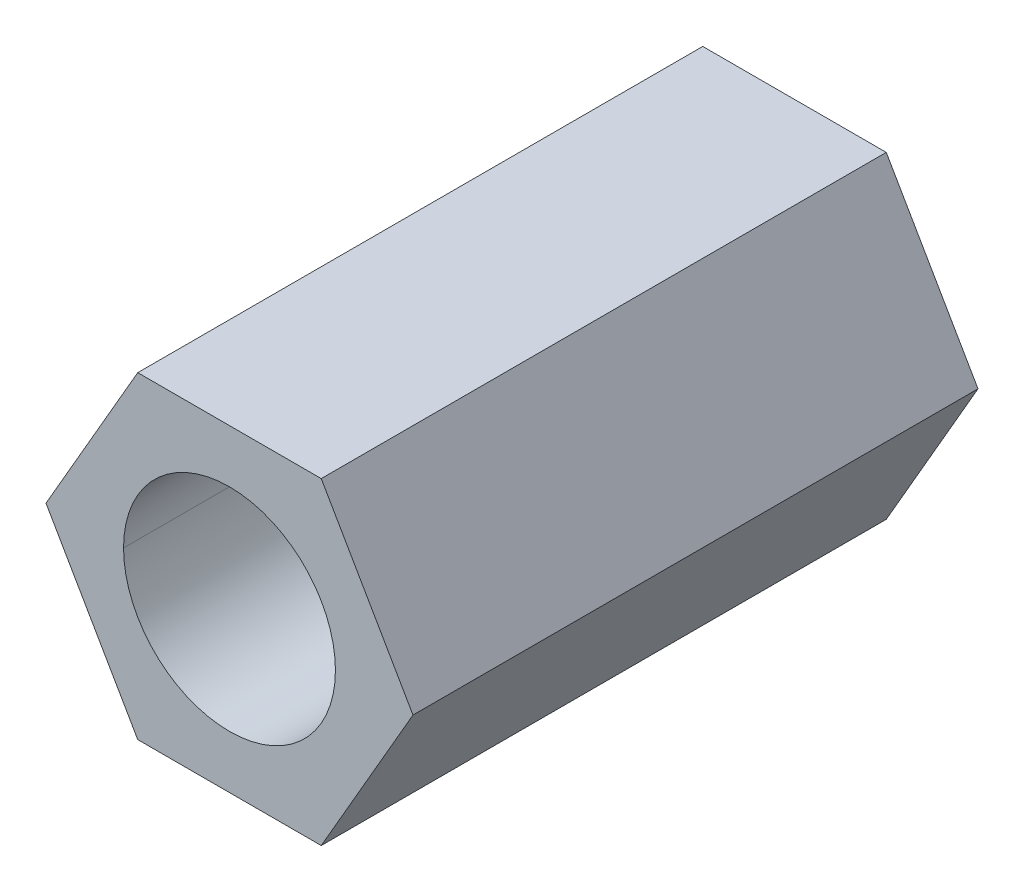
ISO-10303-21;
HEADER;
FILE_DESCRIPTION(('STEP AP214'),'2;1');
FILE_NAME('part.step','',(''),(''),'','','');
FILE_SCHEMA(('AUTOMOTIVE_DESIGN { 1 0 10303 214 1 1 1 1 }'));
ENDSEC;
DATA;
#1=APPLICATION_CONTEXT('core data for automotive mechanical design processes');
#2=APPLICATION_PROTOCOL_DEFINITION('international standard','automotive_design',2000,#1);
#3=PRODUCT_CONTEXT('',#1,'mechanical');
#4=PRODUCT('Part','Part','',(#3));
#5=PRODUCT_RELATED_PRODUCT_CATEGORY('part','',(#4));
#6=PRODUCT_DEFINITION_FORMATION('','',#4);
#7=PRODUCT_DEFINITION_CONTEXT('part definition',#1,'design');
#8=PRODUCT_DEFINITION('design','',#6,#7);
#9=PRODUCT_DEFINITION_SHAPE('','',#8);
#10=(LENGTH_UNIT() NAMED_UNIT(*) SI_UNIT(.MILLI.,.METRE.));
#11=(NAMED_UNIT(*) PLANE_ANGLE_UNIT() SI_UNIT($,.RADIAN.));
#12=(NAMED_UNIT(*) SI_UNIT($,.STERADIAN.) SOLID_ANGLE_UNIT());
#13=UNCERTAINTY_MEASURE_WITH_UNIT(LENGTH_MEASURE(1.E-05),#10,'distance_accuracy_value','');
#14=(GEOMETRIC_REPRESENTATION_CONTEXT(3) GLOBAL_UNCERTAINTY_ASSIGNED_CONTEXT((#13)) GLOBAL_UNIT_ASSIGNED_CONTEXT((#10,
#11,#12)) REPRESENTATION_CONTEXT('',''));
#15=CARTESIAN_POINT('',(0.,0.,0.));
#16=DIRECTION('',(0.,0.,1.));
#17=DIRECTION('',(1.,0.,0.));
#18=AXIS2_PLACEMENT_3D('',#15,#16,#17);
#19=CARTESIAN_POINT('',(1.299038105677,-2.25,0.));
#20=DIRECTION('',(0.866025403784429,-0.500000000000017,0.));
#21=DIRECTION('',(0.,0.,-1.));
#22=AXIS2_PLACEMENT_3D('',#19,#20,#21);
#23=PLANE('',#22);
#24=DIRECTION('',(0.,0.,1.));
#25=VECTOR('',#24,1.);
#26=CARTESIAN_POINT('',(2.598076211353,0.,0.));
#27=LINE('',#26,#25);
#28=CARTESIAN_POINT('',(2.598076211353,0.,0.));
#29=VERTEX_POINT('',#28);
#30=CARTESIAN_POINT('',(2.598076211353,0.,8.));
#31=VERTEX_POINT('',#30);
#32=EDGE_CURVE('E11',#29,#31,#27,.T.);
#33=ORIENTED_EDGE('',*,*,#32,.T.);
#34=DIRECTION('',(0.500000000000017,0.866025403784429,0.));
#35=VECTOR('',#34,1.);
#36=CARTESIAN_POINT('',(1.299038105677,-2.25,8.));
#37=LINE('',#36,#35);
#38=CARTESIAN_POINT('',(1.299038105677,-2.25,8.));
#39=VERTEX_POINT('',#38);
#40=EDGE_CURVE('E122',#39,#31,#37,.T.);
#41=ORIENTED_EDGE('',*,*,#40,.F.);
#42=DIRECTION('',(0.,0.,1.));
#43=VECTOR('',#42,1.);
#44=CARTESIAN_POINT('',(1.299038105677,-2.25,0.));
#45=LINE('',#44,#43);
#46=CARTESIAN_POINT('',(1.299038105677,-2.25,0.));
#47=VERTEX_POINT('',#46);
#48=EDGE_CURVE('E108',#47,#39,#45,.T.);
#49=ORIENTED_EDGE('',*,*,#48,.F.);
#50=DIRECTION('',(0.500000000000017,0.866025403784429,0.));
#51=VECTOR('',#50,1.);
#52=CARTESIAN_POINT('',(1.299038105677,-2.25,0.));
#53=LINE('',#52,#51);
#54=EDGE_CURVE('E174',#47,#29,#53,.T.);
#55=ORIENTED_EDGE('',*,*,#54,.T.);
#56=EDGE_LOOP('',(#33,#41,#49,#55));
#57=FACE_BOUND('',#56,.T.);
#58=ADVANCED_FACE('F17',(#57),#23,.T.);
#59=CARTESIAN_POINT('',(2.598076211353,0.,0.));
#60=DIRECTION('',(0.866025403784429,0.500000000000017,0.));
#61=DIRECTION('',(0.,0.,-1.));
#62=AXIS2_PLACEMENT_3D('',#59,#60,#61);
#63=PLANE('',#62);
#64=DIRECTION('',(0.,0.,1.));
#65=VECTOR('',#64,1.);
#66=CARTESIAN_POINT('',(1.299038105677,2.25,0.));
#67=LINE('',#66,#65);
#68=CARTESIAN_POINT('',(1.299038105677,2.25,0.));
#69=VERTEX_POINT('',#68);
#70=CARTESIAN_POINT('',(1.299038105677,2.25,8.));
#71=VERTEX_POINT('',#70);
#72=EDGE_CURVE('E28',#69,#71,#67,.T.);
#73=ORIENTED_EDGE('',*,*,#72,.T.);
#74=DIRECTION('',(-0.500000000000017,0.866025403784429,0.));
#75=VECTOR('',#74,1.);
#76=CARTESIAN_POINT('',(2.598076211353,0.,8.));
#77=LINE('',#76,#75);
#78=EDGE_CURVE('E128',#31,#71,#77,.T.);
#79=ORIENTED_EDGE('',*,*,#78,.F.);
#80=ORIENTED_EDGE('',*,*,#32,.F.);
#81=DIRECTION('',(-0.500000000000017,0.866025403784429,0.));
#82=VECTOR('',#81,1.);
#83=CARTESIAN_POINT('',(2.598076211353,0.,0.));
#84=LINE('',#83,#82);
#85=EDGE_CURVE('E177',#29,#69,#84,.T.);
#86=ORIENTED_EDGE('',*,*,#85,.T.);
#87=EDGE_LOOP('',(#73,#79,#80,#86));
#88=FACE_BOUND('',#87,.T.);
#89=ADVANCED_FACE('F204',(#88),#63,.T.);
#90=CARTESIAN_POINT('',(1.299038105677,2.25,0.));
#91=DIRECTION('',(0.,1.,0.));
#92=DIRECTION('',(1.,0.,0.));
#93=AXIS2_PLACEMENT_3D('',#90,#91,#92);
#94=PLANE('',#93);
#95=DIRECTION('',(0.,0.,1.));
#96=VECTOR('',#95,1.);
#97=CARTESIAN_POINT('',(-1.299038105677,2.25,0.));
#98=LINE('',#97,#96);
#99=CARTESIAN_POINT('',(-1.299038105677,2.25,0.));
#100=VERTEX_POINT('',#99);
#101=CARTESIAN_POINT('',(-1.299038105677,2.25,8.));
#102=VERTEX_POINT('',#101);
#103=EDGE_CURVE('E145',#100,#102,#98,.T.);
#104=ORIENTED_EDGE('',*,*,#103,.T.);
#105=DIRECTION('',(-1.,0.,0.));
#106=VECTOR('',#105,1.);
#107=CARTESIAN_POINT('',(1.299038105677,2.25,8.));
#108=LINE('',#107,#106);
#109=EDGE_CURVE('E135',#71,#102,#108,.T.);
#110=ORIENTED_EDGE('',*,*,#109,.F.);
#111=ORIENTED_EDGE('',*,*,#72,.F.);
#112=DIRECTION('',(-1.,0.,0.));
#113=VECTOR('',#112,1.);
#114=CARTESIAN_POINT('',(1.299038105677,2.25,0.));
#115=LINE('',#114,#113);
#116=EDGE_CURVE('E151',#69,#100,#115,.T.);
#117=ORIENTED_EDGE('',*,*,#116,.T.);
#118=EDGE_LOOP('',(#104,#110,#111,#117));
#119=FACE_BOUND('',#118,.T.);
#120=ADVANCED_FACE('F209',(#119),#94,.T.);
#121=CARTESIAN_POINT('',(-1.299038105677,2.25,0.));
#122=DIRECTION('',(-0.866025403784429,0.500000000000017,0.));
#123=DIRECTION('',(0.,0.,1.));
#124=AXIS2_PLACEMENT_3D('',#121,#122,#123);
#125=PLANE('',#124);
#126=DIRECTION('',(0.,0.,1.));
#127=VECTOR('',#126,1.);
#128=CARTESIAN_POINT('',(-2.598076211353,0.,0.));
#129=LINE('',#128,#127);
#130=CARTESIAN_POINT('',(-2.598076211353,0.,0.));
#131=VERTEX_POINT('',#130);
#132=CARTESIAN_POINT('',(-2.598076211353,0.,8.));
#133=VERTEX_POINT('',#132);
#134=EDGE_CURVE('E21',#131,#133,#129,.T.);
#135=ORIENTED_EDGE('',*,*,#134,.T.);
#136=DIRECTION('',(-0.500000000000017,-0.866025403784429,0.));
#137=VECTOR('',#136,1.);
#138=CARTESIAN_POINT('',(-1.299038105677,2.25,8.));
#139=LINE('',#138,#137);
#140=EDGE_CURVE('E140',#102,#133,#139,.T.);
#141=ORIENTED_EDGE('',*,*,#140,.F.);
#142=ORIENTED_EDGE('',*,*,#103,.F.);
#143=DIRECTION('',(-0.500000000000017,-0.866025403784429,0.));
#144=VECTOR('',#143,1.);
#145=CARTESIAN_POINT('',(-1.299038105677,2.25,0.));
#146=LINE('',#145,#144);
#147=EDGE_CURVE('E147',#100,#131,#146,.T.);
#148=ORIENTED_EDGE('',*,*,#147,.T.);
#149=EDGE_LOOP('',(#135,#141,#142,#148));
#150=FACE_BOUND('',#149,.T.);
#151=ADVANCED_FACE('F213',(#150),#125,.T.);
#152=CARTESIAN_POINT('',(-2.598076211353,0.,0.));
#153=DIRECTION('',(-0.866025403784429,-0.500000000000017,0.));
#154=DIRECTION('',(-0.500000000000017,0.866025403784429,0.));
#155=AXIS2_PLACEMENT_3D('',#152,#153,#154);
#156=PLANE('',#155);
#157=DIRECTION('',(0.,0.,1.));
#158=VECTOR('',#157,1.);
#159=CARTESIAN_POINT('',(-1.299038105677,-2.25,0.));
#160=LINE('',#159,#158);
#161=CARTESIAN_POINT('',(-1.299038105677,-2.25,0.));
#162=VERTEX_POINT('',#161);
#163=CARTESIAN_POINT('',(-1.299038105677,-2.25,8.));
#164=VERTEX_POINT('',#163);
#165=EDGE_CURVE('E42',#162,#164,#160,.T.);
#166=ORIENTED_EDGE('',*,*,#165,.T.);
#167=DIRECTION('',(0.500000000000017,-0.866025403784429,0.));
#168=VECTOR('',#167,1.);
#169=CARTESIAN_POINT('',(-2.598076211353,0.,8.));
#170=LINE('',#169,#168);
#171=EDGE_CURVE('E124',#133,#164,#170,.T.);
#172=ORIENTED_EDGE('',*,*,#171,.F.);
#173=ORIENTED_EDGE('',*,*,#134,.F.);
#174=DIRECTION('',(0.500000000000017,-0.866025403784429,0.));
#175=VECTOR('',#174,1.);
#176=CARTESIAN_POINT('',(-2.598076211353,0.,0.));
#177=LINE('',#176,#175);
#178=EDGE_CURVE('E152',#131,#162,#177,.T.);
#179=ORIENTED_EDGE('',*,*,#178,.T.);
#180=EDGE_LOOP('',(#166,#172,#173,#179));
#181=FACE_BOUND('',#180,.T.);
#182=ADVANCED_FACE('F200',(#181),#156,.T.);
#183=CARTESIAN_POINT('',(-1.299038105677,-2.25,0.));
#184=DIRECTION('',(0.,-1.,0.));
#185=DIRECTION('',(0.,0.,-1.));
#186=AXIS2_PLACEMENT_3D('',#183,#184,#185);
#187=PLANE('',#186);
#188=ORIENTED_EDGE('',*,*,#48,.T.);
#189=DIRECTION('',(1.,0.,0.));
#190=VECTOR('',#189,1.);
#191=CARTESIAN_POINT('',(-1.299038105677,-2.25,8.));
#192=LINE('',#191,#190);
#193=EDGE_CURVE('E111',#164,#39,#192,.T.);
#194=ORIENTED_EDGE('',*,*,#193,.F.);
#195=ORIENTED_EDGE('',*,*,#165,.F.);
#196=DIRECTION('',(1.,0.,0.));
#197=VECTOR('',#196,1.);
#198=CARTESIAN_POINT('',(-1.299038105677,-2.25,0.));
#199=LINE('',#198,#197);
#200=EDGE_CURVE('E114',#162,#47,#199,.T.);
#201=ORIENTED_EDGE('',*,*,#200,.T.);
#202=EDGE_LOOP('',(#188,#194,#195,#201));
#203=FACE_BOUND('',#202,.T.);
#204=ADVANCED_FACE('F110',(#203),#187,.T.);
#205=CARTESIAN_POINT('',(0.,0.,8.));
#206=DIRECTION('',(0.,0.,1.));
#207=DIRECTION('',(1.,0.,0.));
#208=AXIS2_PLACEMENT_3D('',#205,#206,#207);
#209=PLANE('',#208);
#210=CARTESIAN_POINT('',(0.,0.,8.));
#211=DIRECTION('',(0.,0.,-1.));
#212=DIRECTION('',(-1.,0.,0.));
#213=AXIS2_PLACEMENT_3D('',#210,#211,#212);
#214=CIRCLE('',#213,1.5);
#215=CARTESIAN_POINT('',(-1.5,0.,8.));
#216=VERTEX_POINT('',#215);
#217=CARTESIAN_POINT('',(1.5,0.,8.));
#218=VERTEX_POINT('',#217);
#219=EDGE_CURVE('E129',#216,#218,#214,.T.);
#220=ORIENTED_EDGE('',*,*,#219,.T.);
#221=CARTESIAN_POINT('',(0.,0.,8.));
#222=DIRECTION('',(0.,0.,-1.));
#223=DIRECTION('',(1.,0.,0.));
#224=AXIS2_PLACEMENT_3D('',#221,#222,#223);
#225=CIRCLE('',#224,1.5);
#226=EDGE_CURVE('E157',#218,#216,#225,.T.);
#227=ORIENTED_EDGE('',*,*,#226,.T.);
#228=EDGE_LOOP('',(#220,#227));
#229=FACE_BOUND('',#228,.T.);
#230=ORIENTED_EDGE('',*,*,#40,.T.);
#231=ORIENTED_EDGE('',*,*,#78,.T.);
#232=ORIENTED_EDGE('',*,*,#109,.T.);
#233=ORIENTED_EDGE('',*,*,#140,.T.);
#234=ORIENTED_EDGE('',*,*,#171,.T.);
#235=ORIENTED_EDGE('',*,*,#193,.T.);
#236=EDGE_LOOP('',(#230,#231,#232,#233,#234,#235));
#237=FACE_BOUND('',#236,.T.);
#238=ADVANCED_FACE('F120',(#229,#237),#209,.T.);
#239=CARTESIAN_POINT('',(0.,0.,0.));
#240=DIRECTION('',(0.,0.,1.));
#241=DIRECTION('',(1.,0.,0.));
#242=AXIS2_PLACEMENT_3D('',#239,#240,#241);
#243=CYLINDRICAL_SURFACE('',#242,1.5);
#244=DIRECTION('',(0.,0.,1.));
#245=VECTOR('',#244,1.);
#246=CARTESIAN_POINT('',(1.5,0.,0.));
#247=LINE('',#246,#245);
#248=CARTESIAN_POINT('',(1.5,0.,0.));
#249=VERTEX_POINT('',#248);
#250=EDGE_CURVE('E136',#249,#218,#247,.T.);
#251=ORIENTED_EDGE('',*,*,#250,.T.);
#252=ORIENTED_EDGE('',*,*,#219,.F.);
#253=DIRECTION('',(0.,0.,1.));
#254=VECTOR('',#253,1.);
#255=CARTESIAN_POINT('',(-1.5,0.,0.));
#256=LINE('',#255,#254);
#257=CARTESIAN_POINT('',(-1.5,0.,0.));
#258=VERTEX_POINT('',#257);
#259=EDGE_CURVE('E153',#258,#216,#256,.T.);
#260=ORIENTED_EDGE('',*,*,#259,.F.);
#261=CARTESIAN_POINT('',(0.,0.,0.));
#262=DIRECTION('',(0.,0.,-1.));
#263=DIRECTION('',(-1.,0.,0.));
#264=AXIS2_PLACEMENT_3D('',#261,#262,#263);
#265=CIRCLE('',#264,1.5);
#266=EDGE_CURVE('E171',#258,#249,#265,.T.);
#267=ORIENTED_EDGE('',*,*,#266,.T.);
#268=EDGE_LOOP('',(#251,#252,#260,#267));
#269=FACE_BOUND('',#268,.T.);
#270=ADVANCED_FACE('F185',(#269),#243,.F.);
#271=CARTESIAN_POINT('',(0.,0.,0.));
#272=DIRECTION('',(0.,0.,1.));
#273=DIRECTION('',(1.,0.,0.));
#274=AXIS2_PLACEMENT_3D('',#271,#272,#273);
#275=CYLINDRICAL_SURFACE('',#274,1.5);
#276=ORIENTED_EDGE('',*,*,#259,.T.);
#277=ORIENTED_EDGE('',*,*,#226,.F.);
#278=ORIENTED_EDGE('',*,*,#250,.F.);
#279=CARTESIAN_POINT('',(0.,0.,0.));
#280=DIRECTION('',(0.,0.,-1.));
#281=DIRECTION('',(1.,0.,0.));
#282=AXIS2_PLACEMENT_3D('',#279,#280,#281);
#283=CIRCLE('',#282,1.5);
#284=EDGE_CURVE('E158',#249,#258,#283,.T.);
#285=ORIENTED_EDGE('',*,*,#284,.T.);
#286=EDGE_LOOP('',(#276,#277,#278,#285));
#287=FACE_BOUND('',#286,.T.);
#288=ADVANCED_FACE('F19',(#287),#275,.F.);
#289=CARTESIAN_POINT('',(0.,0.,0.));
#290=DIRECTION('',(0.,0.,1.));
#291=DIRECTION('',(1.,0.,0.));
#292=AXIS2_PLACEMENT_3D('',#289,#290,#291);
#293=PLANE('',#292);
#294=ORIENTED_EDGE('',*,*,#266,.F.);
#295=ORIENTED_EDGE('',*,*,#284,.F.);
#296=EDGE_LOOP('',(#294,#295));
#297=FACE_BOUND('',#296,.T.);
#298=ORIENTED_EDGE('',*,*,#178,.F.);
#299=ORIENTED_EDGE('',*,*,#147,.F.);
#300=ORIENTED_EDGE('',*,*,#116,.F.);
#301=ORIENTED_EDGE('',*,*,#85,.F.);
#302=ORIENTED_EDGE('',*,*,#54,.F.);
#303=ORIENTED_EDGE('',*,*,#200,.F.);
#304=EDGE_LOOP('',(#298,#299,#300,#301,#302,#303));
#305=FACE_BOUND('',#304,.T.);
#306=ADVANCED_FACE('F214',(#297,#305),#293,.F.);
#307=CLOSED_SHELL('',(#58,#89,#120,#151,#182,#204,#238,#270,#288,#306));
#308=MANIFOLD_SOLID_BREP('B1',#307);
#309=ADVANCED_BREP_SHAPE_REPRESENTATION('',(#18,#308),#14);
#310=SHAPE_DEFINITION_REPRESENTATION(#9,#309);
ENDSEC;
END-ISO-10303-21;
